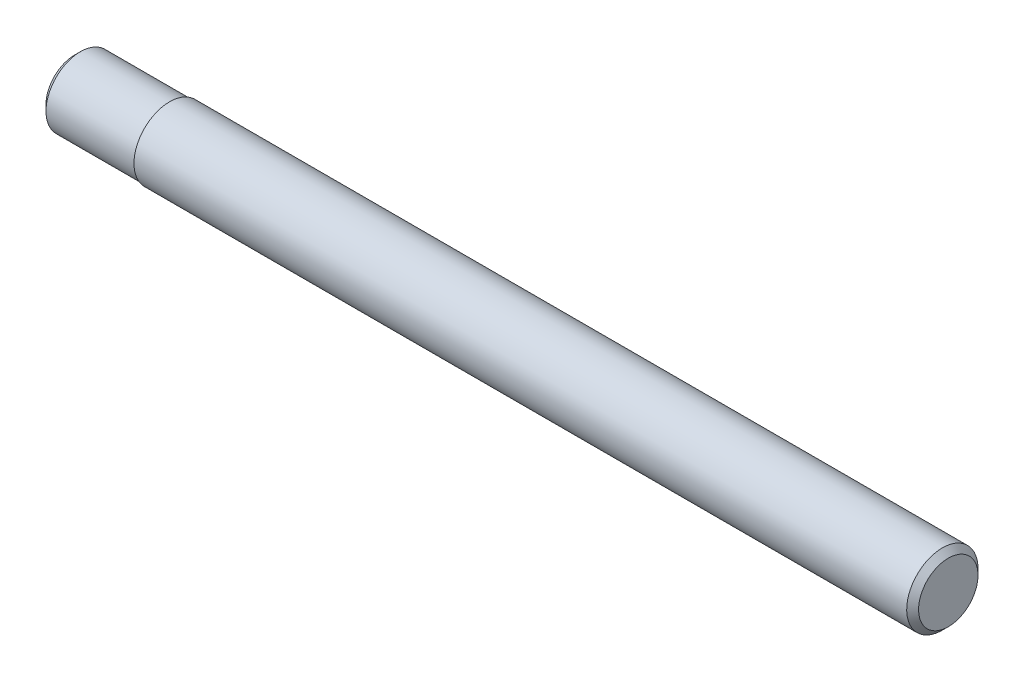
ISO-10303-21;
HEADER;
FILE_DESCRIPTION(('STEP AP214'),'2;1');
FILE_NAME('part.step','',(''),(''),'','','');
FILE_SCHEMA(('AUTOMOTIVE_DESIGN { 1 0 10303 214 1 1 1 1 }'));
ENDSEC;
DATA;
#1=APPLICATION_CONTEXT('core data for automotive mechanical design processes');
#2=APPLICATION_PROTOCOL_DEFINITION('international standard','automotive_design',2000,#1);
#3=PRODUCT_CONTEXT('',#1,'mechanical');
#4=PRODUCT('Part','Part','',(#3));
#5=PRODUCT_RELATED_PRODUCT_CATEGORY('part','',(#4));
#6=PRODUCT_DEFINITION_FORMATION('','',#4);
#7=PRODUCT_DEFINITION_CONTEXT('part definition',#1,'design');
#8=PRODUCT_DEFINITION('design','',#6,#7);
#9=PRODUCT_DEFINITION_SHAPE('','',#8);
#10=(LENGTH_UNIT() NAMED_UNIT(*) SI_UNIT(.MILLI.,.METRE.));
#11=(NAMED_UNIT(*) PLANE_ANGLE_UNIT() SI_UNIT($,.RADIAN.));
#12=(NAMED_UNIT(*) SI_UNIT($,.STERADIAN.) SOLID_ANGLE_UNIT());
#13=UNCERTAINTY_MEASURE_WITH_UNIT(LENGTH_MEASURE(1.E-05),#10,'distance_accuracy_value','');
#14=(GEOMETRIC_REPRESENTATION_CONTEXT(3) GLOBAL_UNCERTAINTY_ASSIGNED_CONTEXT((#13)) GLOBAL_UNIT_ASSIGNED_CONTEXT((#10,
#11,#12)) REPRESENTATION_CONTEXT('',''));
#15=CARTESIAN_POINT('',(0.,0.,0.));
#16=DIRECTION('',(0.,0.,1.));
#17=DIRECTION('',(1.,0.,0.));
#18=AXIS2_PLACEMENT_3D('',#15,#16,#17);
#19=CARTESIAN_POINT('',(25.,-2.49999999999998,0.));
#20=DIRECTION('',(1.,0.,0.));
#21=DIRECTION('',(0.,1.,0.));
#22=AXIS2_PLACEMENT_3D('',#19,#20,#21);
#23=PLANE('',#22);
#24=CARTESIAN_POINT('',(25.,0.,0.));
#25=DIRECTION('',(1.,0.,0.));
#26=DIRECTION('',(0.,1.,0.));
#27=AXIS2_PLACEMENT_3D('',#24,#25,#26);
#28=CIRCLE('',#27,2.49999999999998);
#29=CARTESIAN_POINT('',(25.,2.49999999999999,0.));
#30=VERTEX_POINT('',#29);
#31=EDGE_CURVE('E10',#30,#30,#28,.T.);
#32=ORIENTED_EDGE('',*,*,#31,.T.);
#33=EDGE_LOOP('',(#32));
#34=FACE_BOUND('',#33,.T.);
#35=ADVANCED_FACE('F33',(#34),#23,.T.);
#36=CARTESIAN_POINT('',(25.,0.,0.));
#37=DIRECTION('',(-1.,0.,0.));
#38=DIRECTION('',(0.,-1.,0.));
#39=AXIS2_PLACEMENT_3D('',#36,#37,#38);
#40=CONICAL_SURFACE('',#39,2.49999999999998,0.785398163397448);
#41=CARTESIAN_POINT('',(24.5,0.,0.));
#42=DIRECTION('',(1.,0.,0.));
#43=DIRECTION('',(0.,1.,0.));
#44=AXIS2_PLACEMENT_3D('',#41,#42,#43);
#45=CIRCLE('',#44,2.99999999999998);
#46=CARTESIAN_POINT('',(24.5,2.99999999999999,0.));
#47=VERTEX_POINT('',#46);
#48=EDGE_CURVE('E39',#47,#47,#45,.T.);
#49=ORIENTED_EDGE('',*,*,#48,.T.);
#50=EDGE_LOOP('',(#49));
#51=FACE_BOUND('',#50,.T.);
#52=ORIENTED_EDGE('',*,*,#31,.F.);
#53=EDGE_LOOP('',(#52));
#54=FACE_BOUND('',#53,.T.);
#55=ADVANCED_FACE('F71',(#51,#54),#40,.T.);
#56=CARTESIAN_POINT('',(0.,0.,0.));
#57=DIRECTION('',(1.,0.,0.));
#58=DIRECTION('',(0.,1.,0.));
#59=AXIS2_PLACEMENT_3D('',#56,#57,#58);
#60=CYLINDRICAL_SURFACE('',#59,2.99999999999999);
#61=CARTESIAN_POINT('',(-40.5,0.,0.));
#62=DIRECTION('',(1.,0.,0.));
#63=DIRECTION('',(0.,1.,0.));
#64=AXIS2_PLACEMENT_3D('',#61,#62,#63);
#65=CIRCLE('',#64,3.);
#66=CARTESIAN_POINT('',(-40.5,2.99999999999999,0.));
#67=VERTEX_POINT('',#66);
#68=EDGE_CURVE('E43',#67,#67,#65,.T.);
#69=ORIENTED_EDGE('',*,*,#68,.T.);
#70=EDGE_LOOP('',(#69));
#71=FACE_BOUND('',#70,.T.);
#72=ORIENTED_EDGE('',*,*,#48,.F.);
#73=EDGE_LOOP('',(#72));
#74=FACE_BOUND('',#73,.T.);
#75=ADVANCED_FACE('F75',(#71,#74),#60,.T.);
#76=CARTESIAN_POINT('',(-40.5,-2.90000000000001,0.));
#77=DIRECTION('',(-1.,0.,0.));
#78=DIRECTION('',(0.,-1.,0.));
#79=AXIS2_PLACEMENT_3D('',#76,#77,#78);
#80=PLANE('',#79);
#81=CARTESIAN_POINT('',(-40.5,0.,0.));
#82=DIRECTION('',(1.,0.,0.));
#83=DIRECTION('',(0.,1.,0.));
#84=AXIS2_PLACEMENT_3D('',#81,#82,#83);
#85=CIRCLE('',#84,2.9);
#86=CARTESIAN_POINT('',(-40.5,2.9,0.));
#87=VERTEX_POINT('',#86);
#88=EDGE_CURVE('E47',#87,#87,#85,.T.);
#89=ORIENTED_EDGE('',*,*,#88,.T.);
#90=EDGE_LOOP('',(#89));
#91=FACE_BOUND('',#90,.T.);
#92=ORIENTED_EDGE('',*,*,#68,.F.);
#93=EDGE_LOOP('',(#92));
#94=FACE_BOUND('',#93,.T.);
#95=ADVANCED_FACE('F79',(#91,#94),#80,.T.);
#96=CARTESIAN_POINT('',(0.,0.,0.));
#97=DIRECTION('',(1.,0.,0.));
#98=DIRECTION('',(0.,1.,0.));
#99=AXIS2_PLACEMENT_3D('',#96,#97,#98);
#100=CYLINDRICAL_SURFACE('',#99,2.9);
#101=CARTESIAN_POINT('',(-48.,0.,0.));
#102=DIRECTION('',(1.,0.,0.));
#103=DIRECTION('',(0.,1.,0.));
#104=AXIS2_PLACEMENT_3D('',#101,#102,#103);
#105=CIRCLE('',#104,2.9);
#106=CARTESIAN_POINT('',(-48.,2.89999999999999,0.));
#107=VERTEX_POINT('',#106);
#108=EDGE_CURVE('E52',#107,#107,#105,.T.);
#109=ORIENTED_EDGE('',*,*,#108,.T.);
#110=EDGE_LOOP('',(#109));
#111=FACE_BOUND('',#110,.T.);
#112=ORIENTED_EDGE('',*,*,#88,.F.);
#113=EDGE_LOOP('',(#112));
#114=FACE_BOUND('',#113,.T.);
#115=ADVANCED_FACE('F68',(#111,#114),#100,.T.);
#116=CARTESIAN_POINT('',(-48.,0.,0.));
#117=DIRECTION('',(1.,0.,0.));
#118=DIRECTION('',(0.,1.,0.));
#119=AXIS2_PLACEMENT_3D('',#116,#117,#118);
#120=CONICAL_SURFACE('',#119,2.9,0.785398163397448);
#121=CARTESIAN_POINT('',(-48.5,0.,0.));
#122=DIRECTION('',(1.,0.,0.));
#123=DIRECTION('',(0.,1.,0.));
#124=AXIS2_PLACEMENT_3D('',#121,#122,#123);
#125=CIRCLE('',#124,2.4);
#126=CARTESIAN_POINT('',(-48.5,2.39999999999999,0.));
#127=VERTEX_POINT('',#126);
#128=EDGE_CURVE('E55',#127,#127,#125,.T.);
#129=ORIENTED_EDGE('',*,*,#128,.T.);
#130=EDGE_LOOP('',(#129));
#131=FACE_BOUND('',#130,.T.);
#132=ORIENTED_EDGE('',*,*,#108,.F.);
#133=EDGE_LOOP('',(#132));
#134=FACE_BOUND('',#133,.T.);
#135=ADVANCED_FACE('F59',(#131,#134),#120,.T.);
#136=CARTESIAN_POINT('',(-48.5,-2.40000000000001,0.));
#137=DIRECTION('',(-1.,0.,0.));
#138=DIRECTION('',(0.,-1.,0.));
#139=AXIS2_PLACEMENT_3D('',#136,#137,#138);
#140=PLANE('',#139);
#141=ORIENTED_EDGE('',*,*,#128,.F.);
#142=EDGE_LOOP('',(#141));
#143=FACE_BOUND('',#142,.T.);
#144=ADVANCED_FACE('F62',(#143),#140,.T.);
#145=CLOSED_SHELL('',(#35,#55,#75,#95,#115,#135,#144));
#146=MANIFOLD_SOLID_BREP('B2',#145);
#147=ADVANCED_BREP_SHAPE_REPRESENTATION('',(#18,#146),#14);
#148=SHAPE_DEFINITION_REPRESENTATION(#9,#147);
ENDSEC;
END-ISO-10303-21;
